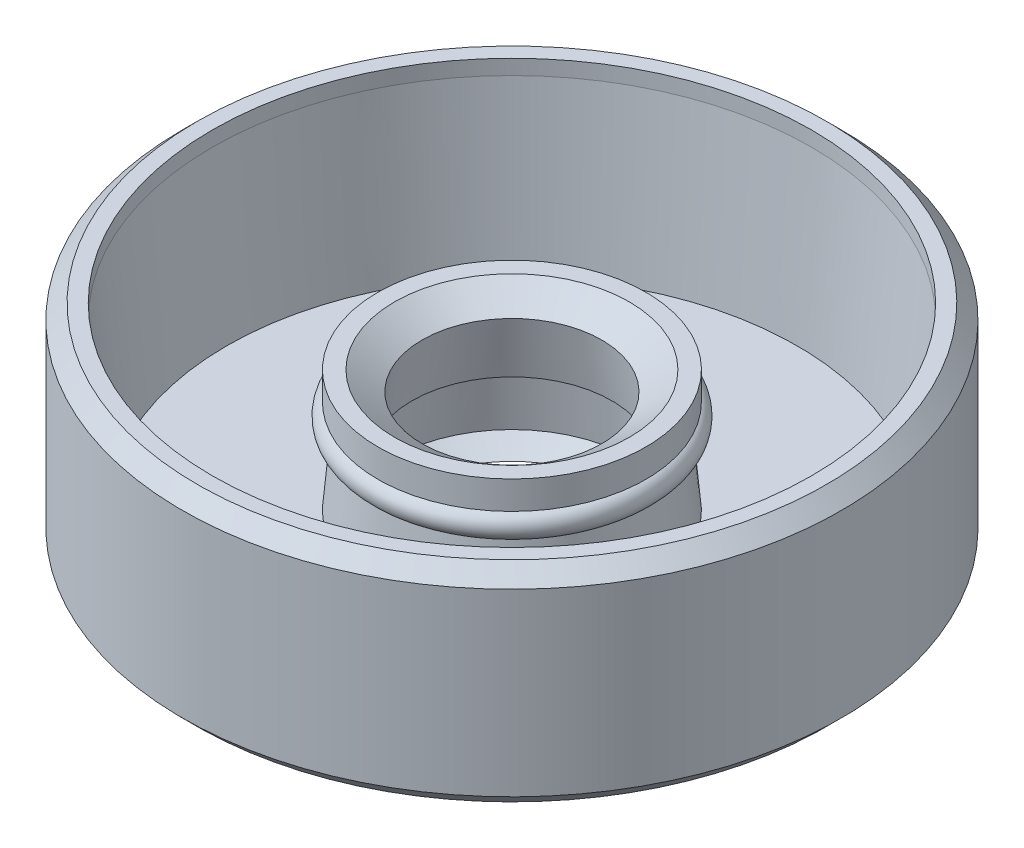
from build123d import *


with BuildPart() as part:
    # Sketch 1 → Revolve 1 (revolve)
    with BuildSketch(Plane.XY):
        with BuildLine():
            Line((-10.5, 0), (-4.473202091, 0))
            Line((-4.473202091, 0), (-4.473202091, 0.5))
            Line((-4.473202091, 0.5), (-4.015036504, 0))
            Line((-4.015036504, 0), (-3.340059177, 0.059052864))
            Line((-3.340059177, 0.059052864), (-4.015036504, 0.5))
            Line((-4.015036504, 0.5), (-3.840059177, 2.5))
            Line((-3.840059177, 2.5), (-3.340059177, 2.5))
            Line((-3.340059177, 2.5), (-3, 4.428571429))
            Line((-3, 4.428571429), (-3.918095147, 5.071428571))
            Line((-3.918095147, 5.071428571), (-4.473202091, 5.071428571))
            Line((-4.473202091, 5.071428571), (-4.473202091, 4.133224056))
            ThreePointArc((-4.473202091, 4.133224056), (-4.708452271, 3.630475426), (-4.273202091, 3.286010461))
            Line((-4.273202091, 3.286010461), (-4.473202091, 1))
            Line((-4.473202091, 1), (-9.518812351, 1))
            Line((-9.518812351, 1), (-10, 6.5))
            Line((-10, 6.5), (-10, 7))
            Line((-10, 7), (-10.5, 7))
            Line((-10.5, 7), (-11, 6.5))
            Line((-11, 6.5), (-11, 0.5))
            Line((-11, 0.5), (-10.5, 0))
        make_face()
    revolve(axis=Axis((0, 5.977335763, 0), (0, -1, 0)))


solid = part.part
